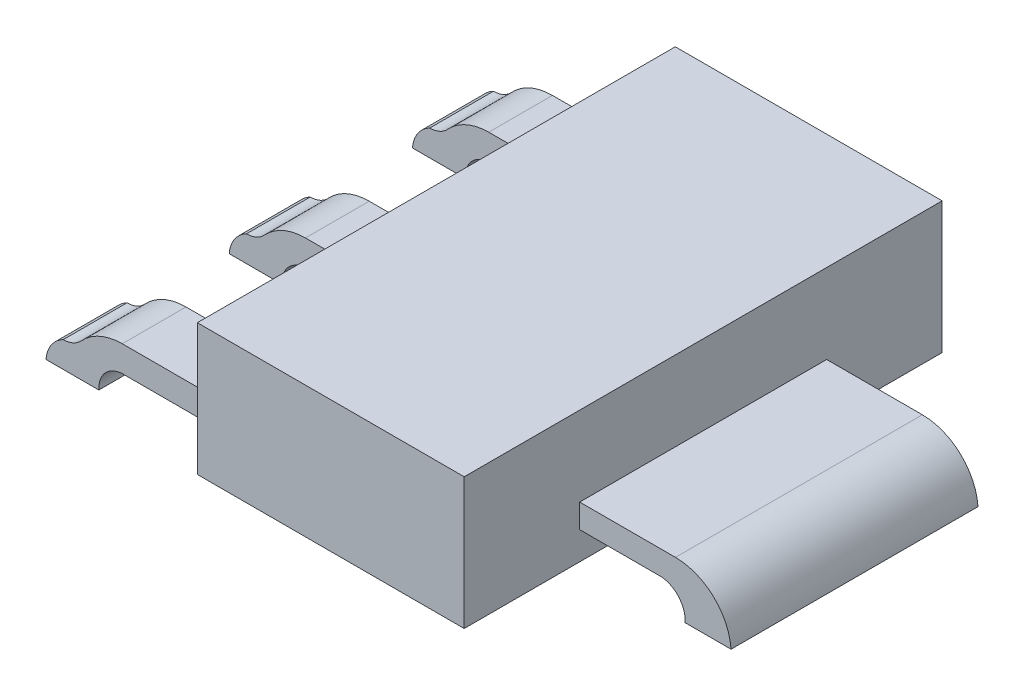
ISO-10303-21;
HEADER;
FILE_DESCRIPTION(('STEP AP214'),'2;1');
FILE_NAME('part.step','',(''),(''),'','','');
FILE_SCHEMA(('AUTOMOTIVE_DESIGN { 1 0 10303 214 1 1 1 1 }'));
ENDSEC;
DATA;
#1=APPLICATION_CONTEXT('core data for automotive mechanical design processes');
#2=APPLICATION_PROTOCOL_DEFINITION('international standard','automotive_design',2000,#1);
#3=PRODUCT_CONTEXT('',#1,'mechanical');
#4=PRODUCT('Part','Part','',(#3));
#5=PRODUCT_RELATED_PRODUCT_CATEGORY('part','',(#4));
#6=PRODUCT_DEFINITION_FORMATION('','',#4);
#7=PRODUCT_DEFINITION_CONTEXT('part definition',#1,'design');
#8=PRODUCT_DEFINITION('design','',#6,#7);
#9=PRODUCT_DEFINITION_SHAPE('','',#8);
#10=(LENGTH_UNIT() NAMED_UNIT(*) SI_UNIT(.MILLI.,.METRE.));
#11=(NAMED_UNIT(*) PLANE_ANGLE_UNIT() SI_UNIT($,.RADIAN.));
#12=(NAMED_UNIT(*) SI_UNIT($,.STERADIAN.) SOLID_ANGLE_UNIT());
#13=UNCERTAINTY_MEASURE_WITH_UNIT(LENGTH_MEASURE(1.E-05),#10,'distance_accuracy_value','');
#14=(GEOMETRIC_REPRESENTATION_CONTEXT(3) GLOBAL_UNCERTAINTY_ASSIGNED_CONTEXT((#13)) GLOBAL_UNIT_ASSIGNED_CONTEXT((#10,
#11,#12)) REPRESENTATION_CONTEXT('',''));
#15=CARTESIAN_POINT('',(0.,0.,0.));
#16=DIRECTION('',(0.,0.,1.));
#17=DIRECTION('',(1.,0.,0.));
#18=AXIS2_PLACEMENT_3D('',#15,#16,#17);
#19=CARTESIAN_POINT('',(1.575,1.651,3.9));
#20=DIRECTION('',(0.,1.,0.));
#21=DIRECTION('',(0.,0.,1.));
#22=AXIS2_PLACEMENT_3D('',#19,#20,#21);
#23=PLANE('',#22);
#24=DIRECTION('',(0.,0.,1.));
#25=VECTOR('',#24,1.);
#26=CARTESIAN_POINT('',(5.15000000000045,1.65100000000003,5.45));
#27=LINE('',#26,#25);
#28=CARTESIAN_POINT('',(5.15000000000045,1.65100000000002,5.45));
#29=VERTEX_POINT('',#28);
#30=CARTESIAN_POINT('',(5.15000000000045,1.65100000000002,2.35));
#31=VERTEX_POINT('',#30);
#32=EDGE_CURVE('E243',#29,#31,#27,.F.);
#33=ORIENTED_EDGE('',*,*,#32,.F.);
#34=DIRECTION('',(1.,0.,0.));
#35=VECTOR('',#34,1.);
#36=CARTESIAN_POINT('',(1.575,1.651,5.45));
#37=LINE('',#36,#35);
#38=CARTESIAN_POINT('',(4.573435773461,1.651,5.45));
#39=VERTEX_POINT('',#38);
#40=EDGE_CURVE('E250',#39,#29,#37,.T.);
#41=ORIENTED_EDGE('',*,*,#40,.F.);
#42=DIRECTION('',(0.,0.,1.));
#43=VECTOR('',#42,1.);
#44=CARTESIAN_POINT('',(4.573435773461,1.651,5.45));
#45=LINE('',#44,#43);
#46=CARTESIAN_POINT('',(4.573435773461,1.651,2.35));
#47=VERTEX_POINT('',#46);
#48=EDGE_CURVE('E246',#39,#47,#45,.F.);
#49=ORIENTED_EDGE('',*,*,#48,.T.);
#50=DIRECTION('',(1.,0.,0.));
#51=VECTOR('',#50,1.);
#52=CARTESIAN_POINT('',(1.575,1.651,2.35));
#53=LINE('',#52,#51);
#54=EDGE_CURVE('E241',#31,#47,#53,.F.);
#55=ORIENTED_EDGE('',*,*,#54,.F.);
#56=EDGE_LOOP('',(#33,#41,#49,#55));
#57=FACE_BOUND('',#56,.T.);
#58=ADVANCED_FACE('F17',(#57),#23,.F.);
#59=CARTESIAN_POINT('',(4.573435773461,1.682463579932,5.45));
#60=DIRECTION('',(1.,0.,0.));
#61=DIRECTION('',(0.,1.,0.));
#62=AXIS2_PLACEMENT_3D('',#59,#60,#61);
#63=PLANE('',#62);
#64=DIRECTION('',(0.,1.,0.));
#65=VECTOR('',#64,1.);
#66=CARTESIAN_POINT('',(4.573435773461,1.682463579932,5.45));
#67=LINE('',#66,#65);
#68=CARTESIAN_POINT('',(4.57343577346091,1.68246357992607,5.45));
#69=VERTEX_POINT('',#68);
#70=EDGE_CURVE('E411',#69,#39,#67,.F.);
#71=ORIENTED_EDGE('',*,*,#70,.F.);
#72=DIRECTION('',(0.,0.,-1.));
#73=VECTOR('',#72,1.);
#74=CARTESIAN_POINT('',(4.57343577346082,1.682463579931,5.45));
#75=LINE('',#74,#73);
#76=CARTESIAN_POINT('',(4.57343577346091,1.68246357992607,2.35));
#77=VERTEX_POINT('',#76);
#78=EDGE_CURVE('E265',#69,#77,#75,.T.);
#79=ORIENTED_EDGE('',*,*,#78,.T.);
#80=DIRECTION('',(0.,1.,0.));
#81=VECTOR('',#80,1.);
#82=CARTESIAN_POINT('',(4.573435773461,1.682463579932,2.35));
#83=LINE('',#82,#81);
#84=EDGE_CURVE('E249',#47,#77,#83,.T.);
#85=ORIENTED_EDGE('',*,*,#84,.F.);
#86=ORIENTED_EDGE('',*,*,#48,.F.);
#87=EDGE_LOOP('',(#71,#79,#85,#86));
#88=FACE_BOUND('',#87,.T.);
#89=ADVANCED_FACE('F1052',(#88),#63,.F.);
#90=CARTESIAN_POINT('',(-2.082924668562,2.281918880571,6.6));
#91=DIRECTION('',(0.,0.,-1.));
#92=DIRECTION('',(-1.,0.,0.));
#93=AXIS2_PLACEMENT_3D('',#90,#91,#92);
#94=CYLINDRICAL_SURFACE('',#93,0.3059188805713);
#95=DIRECTION('',(0.,0.,-1.));
#96=VECTOR('',#95,1.);
#97=CARTESIAN_POINT('',(-2.08292466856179,1.97599999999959,2.));
#98=LINE('',#97,#96);
#99=CARTESIAN_POINT('',(-2.08292466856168,1.97599999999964,2.));
#100=VERTEX_POINT('',#99);
#101=CARTESIAN_POINT('',(-2.08292466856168,1.97599999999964,1.2));
#102=VERTEX_POINT('',#101);
#103=EDGE_CURVE('E376',#100,#102,#98,.T.);
#104=ORIENTED_EDGE('',*,*,#103,.F.);
#105=CARTESIAN_POINT('',(-2.082924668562,2.281918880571,2.));
#106=DIRECTION('',(0.,0.,-1.));
#107=DIRECTION('',(-1.,0.,0.));
#108=AXIS2_PLACEMENT_3D('',#105,#106,#107);
#109=CIRCLE('',#108,0.3059188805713);
#110=CARTESIAN_POINT('',(-1.85774889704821,2.07483862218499,2.));
#111=VERTEX_POINT('',#110);
#112=EDGE_CURVE('E490',#111,#100,#109,.T.);
#113=ORIENTED_EDGE('',*,*,#112,.F.);
#114=DIRECTION('',(0.,0.,1.));
#115=VECTOR('',#114,1.);
#116=CARTESIAN_POINT('',(-1.8577488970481,2.0748386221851,6.6));
#117=LINE('',#116,#115);
#118=CARTESIAN_POINT('',(-1.85774889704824,2.07483862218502,1.2));
#119=VERTEX_POINT('',#118);
#120=EDGE_CURVE('E382',#119,#111,#117,.T.);
#121=ORIENTED_EDGE('',*,*,#120,.F.);
#122=CARTESIAN_POINT('',(-2.082924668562,2.281918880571,1.2));
#123=DIRECTION('',(0.,0.,-1.));
#124=DIRECTION('',(-1.,0.,0.));
#125=AXIS2_PLACEMENT_3D('',#122,#123,#124);
#126=CIRCLE('',#125,0.3059188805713);
#127=EDGE_CURVE('E405',#102,#119,#126,.F.);
#128=ORIENTED_EDGE('',*,*,#127,.F.);
#129=EDGE_LOOP('',(#104,#113,#121,#128));
#130=FACE_BOUND('',#129,.T.);
#131=ADVANCED_FACE('F615',(#130),#94,.F.);
#132=CARTESIAN_POINT('',(-1.342504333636,1.601,6.6));
#133=DIRECTION('',(0.,0.,1.));
#134=DIRECTION('',(1.,0.,0.));
#135=AXIS2_PLACEMENT_3D('',#132,#133,#134);
#136=CYLINDRICAL_SURFACE('',#135,0.7);
#137=CARTESIAN_POINT('',(-1.342504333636,1.601,2.));
#138=DIRECTION('',(0.,0.,1.));
#139=DIRECTION('',(1.,0.,0.));
#140=AXIS2_PLACEMENT_3D('',#137,#138,#139);
#141=CIRCLE('',#140,0.7);
#142=CARTESIAN_POINT('',(-1.342504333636,2.301,2.));
#143=VERTEX_POINT('',#142);
#144=EDGE_CURVE('E492',#143,#111,#141,.T.);
#145=ORIENTED_EDGE('',*,*,#144,.F.);
#146=DIRECTION('',(0.,0.,-1.));
#147=VECTOR('',#146,1.);
#148=CARTESIAN_POINT('',(-1.342504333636,2.301,3.9));
#149=LINE('',#148,#147);
#150=CARTESIAN_POINT('',(-1.342504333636,2.301,1.2));
#151=VERTEX_POINT('',#150);
#152=EDGE_CURVE('E267',#143,#151,#149,.T.);
#153=ORIENTED_EDGE('',*,*,#152,.T.);
#154=CARTESIAN_POINT('',(-1.342504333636,1.601,1.2));
#155=DIRECTION('',(0.,0.,1.));
#156=DIRECTION('',(1.,0.,0.));
#157=AXIS2_PLACEMENT_3D('',#154,#155,#156);
#158=CIRCLE('',#157,0.7);
#159=EDGE_CURVE('E483',#119,#151,#158,.F.);
#160=ORIENTED_EDGE('',*,*,#159,.F.);
#161=ORIENTED_EDGE('',*,*,#120,.T.);
#162=EDGE_LOOP('',(#145,#153,#160,#161));
#163=FACE_BOUND('',#162,.T.);
#164=ADVANCED_FACE('F619',(#163),#136,.T.);
#165=CARTESIAN_POINT('',(-1.331039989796,1.670160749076,6.6));
#166=DIRECTION('',(0.,0.,-1.));
#167=DIRECTION('',(-1.,0.,0.));
#168=AXIS2_PLACEMENT_3D('',#165,#166,#167);
#169=CYLINDRICAL_SURFACE('',#168,0.3058392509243);
#170=CARTESIAN_POINT('',(-1.331039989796,1.670160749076,2.));
#171=DIRECTION('',(0.,0.,-1.));
#172=DIRECTION('',(-1.,0.,0.));
#173=AXIS2_PLACEMENT_3D('',#170,#171,#172);
#174=CIRCLE('',#173,0.3058392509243);
#175=CARTESIAN_POINT('',(-1.63627844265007,1.651,2.));
#176=VERTEX_POINT('',#175);
#177=CARTESIAN_POINT('',(-1.3310399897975,1.976,2.));
#178=VERTEX_POINT('',#177);
#179=EDGE_CURVE('E495',#176,#178,#174,.T.);
#180=ORIENTED_EDGE('',*,*,#179,.F.);
#181=DIRECTION('',(0.,0.,1.));
#182=VECTOR('',#181,1.);
#183=CARTESIAN_POINT('',(-1.63627844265,1.651,3.9));
#184=LINE('',#183,#182);
#185=CARTESIAN_POINT('',(-1.63627844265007,1.651,1.2));
#186=VERTEX_POINT('',#185);
#187=EDGE_CURVE('E378',#176,#186,#184,.F.);
#188=ORIENTED_EDGE('',*,*,#187,.T.);
#189=CARTESIAN_POINT('',(-1.331039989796,1.670160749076,1.2));
#190=DIRECTION('',(0.,0.,-1.));
#191=DIRECTION('',(-1.,0.,0.));
#192=AXIS2_PLACEMENT_3D('',#189,#190,#191);
#193=CIRCLE('',#192,0.3058392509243);
#194=CARTESIAN_POINT('',(-1.3310399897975,1.976,1.2));
#195=VERTEX_POINT('',#194);
#196=EDGE_CURVE('E480',#195,#186,#193,.F.);
#197=ORIENTED_EDGE('',*,*,#196,.F.);
#198=DIRECTION('',(0.,0.,1.));
#199=VECTOR('',#198,1.);
#200=CARTESIAN_POINT('',(-1.331039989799,1.976,6.6));
#201=LINE('',#200,#199);
#202=EDGE_CURVE('E383',#195,#178,#201,.T.);
#203=ORIENTED_EDGE('',*,*,#202,.T.);
#204=EDGE_LOOP('',(#180,#188,#197,#203));
#205=FACE_BOUND('',#204,.T.);
#206=ADVANCED_FACE('F604',(#205),#169,.F.);
#207=CARTESIAN_POINT('',(1.575,1.651,3.9));
#208=DIRECTION('',(0.,1.,0.));
#209=DIRECTION('',(0.,0.,1.));
#210=AXIS2_PLACEMENT_3D('',#207,#208,#209);
#211=PLANE('',#210);
#212=DIRECTION('',(0.,0.,-1.));
#213=VECTOR('',#212,1.);
#214=CARTESIAN_POINT('',(-2.29999999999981,1.65099999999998,2.));
#215=LINE('',#214,#213);
#216=CARTESIAN_POINT('',(-2.29999999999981,1.65099999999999,1.2));
#217=VERTEX_POINT('',#216);
#218=CARTESIAN_POINT('',(-2.29999999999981,1.65099999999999,2.));
#219=VERTEX_POINT('',#218);
#220=EDGE_CURVE('E367',#217,#219,#215,.F.);
#221=ORIENTED_EDGE('',*,*,#220,.F.);
#222=DIRECTION('',(-1.,0.,0.));
#223=VECTOR('',#222,1.);
#224=CARTESIAN_POINT('',(-0.1,1.651,1.2));
#225=LINE('',#224,#223);
#226=EDGE_CURVE('E479',#186,#217,#225,.T.);
#227=ORIENTED_EDGE('',*,*,#226,.F.);
#228=ORIENTED_EDGE('',*,*,#187,.F.);
#229=DIRECTION('',(1.,0.,0.));
#230=VECTOR('',#229,1.);
#231=CARTESIAN_POINT('',(-2.3,1.651,2.));
#232=LINE('',#231,#230);
#233=EDGE_CURVE('E273',#219,#176,#232,.T.);
#234=ORIENTED_EDGE('',*,*,#233,.F.);
#235=EDGE_LOOP('',(#221,#227,#228,#234));
#236=FACE_BOUND('',#235,.T.);
#237=ADVANCED_FACE('F608',(#236),#211,.F.);
#238=CARTESIAN_POINT('',(-1.901230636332,1.619647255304,2.));
#239=DIRECTION('',(0.,0.,-1.));
#240=DIRECTION('',(-1.,0.,0.));
#241=AXIS2_PLACEMENT_3D('',#238,#239,#240);
#242=CYLINDRICAL_SURFACE('',#241,0.4);
#243=ORIENTED_EDGE('',*,*,#220,.T.);
#244=CARTESIAN_POINT('',(-1.901230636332,1.619647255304,2.));
#245=DIRECTION('',(0.,0.,-1.));
#246=DIRECTION('',(-1.,0.,0.));
#247=AXIS2_PLACEMENT_3D('',#244,#245,#246);
#248=CIRCLE('',#247,0.4);
#249=EDGE_CURVE('E387',#100,#219,#248,.F.);
#250=ORIENTED_EDGE('',*,*,#249,.F.);
#251=ORIENTED_EDGE('',*,*,#103,.T.);
#252=CARTESIAN_POINT('',(-1.901230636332,1.619647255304,1.2));
#253=DIRECTION('',(0.,0.,-1.));
#254=DIRECTION('',(-1.,0.,0.));
#255=AXIS2_PLACEMENT_3D('',#252,#253,#254);
#256=CIRCLE('',#255,0.4);
#257=EDGE_CURVE('E360',#217,#102,#256,.T.);
#258=ORIENTED_EDGE('',*,*,#257,.F.);
#259=EDGE_LOOP('',(#243,#250,#251,#258));
#260=FACE_BOUND('',#259,.T.);
#261=ADVANCED_FACE('F620',(#260),#242,.T.);
#262=CARTESIAN_POINT('',(-2.082924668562,2.281918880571,6.6));
#263=DIRECTION('',(0.,0.,-1.));
#264=DIRECTION('',(-1.,0.,0.));
#265=AXIS2_PLACEMENT_3D('',#262,#263,#264);
#266=CYLINDRICAL_SURFACE('',#265,0.3059188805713);
#267=DIRECTION('',(0.,0.,-1.));
#268=VECTOR('',#267,1.);
#269=CARTESIAN_POINT('',(-2.08292466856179,1.97599999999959,4.3));
#270=LINE('',#269,#268);
#271=CARTESIAN_POINT('',(-2.08292466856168,1.97599999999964,4.3));
#272=VERTEX_POINT('',#271);
#273=CARTESIAN_POINT('',(-2.08292466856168,1.97599999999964,3.5));
#274=VERTEX_POINT('',#273);
#275=EDGE_CURVE('E335',#272,#274,#270,.T.);
#276=ORIENTED_EDGE('',*,*,#275,.F.);
#277=CARTESIAN_POINT('',(-2.082924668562,2.281918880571,4.3));
#278=DIRECTION('',(0.,0.,-1.));
#279=DIRECTION('',(-1.,0.,0.));
#280=AXIS2_PLACEMENT_3D('',#277,#278,#279);
#281=CIRCLE('',#280,0.3059188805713);
#282=CARTESIAN_POINT('',(-1.85774889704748,2.07483862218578,4.3));
#283=VERTEX_POINT('',#282);
#284=EDGE_CURVE('E469',#283,#272,#281,.T.);
#285=ORIENTED_EDGE('',*,*,#284,.F.);
#286=DIRECTION('',(0.,0.,1.));
#287=VECTOR('',#286,1.);
#288=CARTESIAN_POINT('',(-1.85774889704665,2.07483862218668,6.6));
#289=LINE('',#288,#287);
#290=CARTESIAN_POINT('',(-1.85774889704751,2.07483862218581,3.5));
#291=VERTEX_POINT('',#290);
#292=EDGE_CURVE('E341',#291,#283,#289,.T.);
#293=ORIENTED_EDGE('',*,*,#292,.F.);
#294=CARTESIAN_POINT('',(-2.082924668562,2.281918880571,3.5));
#295=DIRECTION('',(0.,0.,-1.));
#296=DIRECTION('',(-1.,0.,0.));
#297=AXIS2_PLACEMENT_3D('',#294,#295,#296);
#298=CIRCLE('',#297,0.3059188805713);
#299=EDGE_CURVE('E370',#274,#291,#298,.F.);
#300=ORIENTED_EDGE('',*,*,#299,.F.);
#301=EDGE_LOOP('',(#276,#285,#293,#300));
#302=FACE_BOUND('',#301,.T.);
#303=ADVANCED_FACE('F622',(#302),#266,.F.);
#304=CARTESIAN_POINT('',(-1.342504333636,1.601,6.6));
#305=DIRECTION('',(0.,0.,1.));
#306=DIRECTION('',(1.,0.,0.));
#307=AXIS2_PLACEMENT_3D('',#304,#305,#306);
#308=CYLINDRICAL_SURFACE('',#307,0.7);
#309=CARTESIAN_POINT('',(-1.342504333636,1.601,4.3));
#310=DIRECTION('',(0.,0.,1.));
#311=DIRECTION('',(1.,0.,0.));
#312=AXIS2_PLACEMENT_3D('',#309,#310,#311);
#313=CIRCLE('',#312,0.7);
#314=CARTESIAN_POINT('',(-1.342504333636,2.301,4.3));
#315=VERTEX_POINT('',#314);
#316=EDGE_CURVE('E471',#315,#283,#313,.T.);
#317=ORIENTED_EDGE('',*,*,#316,.F.);
#318=DIRECTION('',(0.,0.,-1.));
#319=VECTOR('',#318,1.);
#320=CARTESIAN_POINT('',(-1.342504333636,2.301,3.9));
#321=LINE('',#320,#319);
#322=CARTESIAN_POINT('',(-1.342504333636,2.301,3.5));
#323=VERTEX_POINT('',#322);
#324=EDGE_CURVE('E356',#315,#323,#321,.T.);
#325=ORIENTED_EDGE('',*,*,#324,.T.);
#326=CARTESIAN_POINT('',(-1.342504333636,1.601,3.5));
#327=DIRECTION('',(0.,0.,1.));
#328=DIRECTION('',(1.,0.,0.));
#329=AXIS2_PLACEMENT_3D('',#326,#327,#328);
#330=CIRCLE('',#329,0.7);
#331=EDGE_CURVE('E462',#291,#323,#330,.F.);
#332=ORIENTED_EDGE('',*,*,#331,.F.);
#333=ORIENTED_EDGE('',*,*,#292,.T.);
#334=EDGE_LOOP('',(#317,#325,#332,#333));
#335=FACE_BOUND('',#334,.T.);
#336=ADVANCED_FACE('F629',(#335),#308,.T.);
#337=CARTESIAN_POINT('',(-1.331039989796,1.670160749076,6.6));
#338=DIRECTION('',(0.,0.,-1.));
#339=DIRECTION('',(-1.,0.,0.));
#340=AXIS2_PLACEMENT_3D('',#337,#338,#339);
#341=CYLINDRICAL_SURFACE('',#340,0.3058392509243);
#342=CARTESIAN_POINT('',(-1.331039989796,1.670160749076,4.3));
#343=DIRECTION('',(0.,0.,-1.));
#344=DIRECTION('',(-1.,0.,0.));
#345=AXIS2_PLACEMENT_3D('',#342,#343,#344);
#346=CIRCLE('',#345,0.3058392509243);
#347=CARTESIAN_POINT('',(-1.63627844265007,1.651,4.3));
#348=VERTEX_POINT('',#347);
#349=CARTESIAN_POINT('',(-1.3310399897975,1.976,4.3));
#350=VERTEX_POINT('',#349);
#351=EDGE_CURVE('E475',#348,#350,#346,.T.);
#352=ORIENTED_EDGE('',*,*,#351,.F.);
#353=DIRECTION('',(0.,0.,1.));
#354=VECTOR('',#353,1.);
#355=CARTESIAN_POINT('',(-1.63627844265,1.651,3.9));
#356=LINE('',#355,#354);
#357=CARTESIAN_POINT('',(-1.63627844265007,1.651,3.5));
#358=VERTEX_POINT('',#357);
#359=EDGE_CURVE('E337',#348,#358,#356,.F.);
#360=ORIENTED_EDGE('',*,*,#359,.T.);
#361=CARTESIAN_POINT('',(-1.331039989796,1.670160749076,3.5));
#362=DIRECTION('',(0.,0.,-1.));
#363=DIRECTION('',(-1.,0.,0.));
#364=AXIS2_PLACEMENT_3D('',#361,#362,#363);
#365=CIRCLE('',#364,0.3058392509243);
#366=CARTESIAN_POINT('',(-1.3310399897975,1.976,3.5));
#367=VERTEX_POINT('',#366);
#368=EDGE_CURVE('E459',#367,#358,#365,.F.);
#369=ORIENTED_EDGE('',*,*,#368,.F.);
#370=DIRECTION('',(0.,0.,1.));
#371=VECTOR('',#370,1.);
#372=CARTESIAN_POINT('',(-1.331039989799,1.976,6.6));
#373=LINE('',#372,#371);
#374=EDGE_CURVE('E342',#367,#350,#373,.T.);
#375=ORIENTED_EDGE('',*,*,#374,.T.);
#376=EDGE_LOOP('',(#352,#360,#369,#375));
#377=FACE_BOUND('',#376,.T.);
#378=ADVANCED_FACE('F738',(#377),#341,.F.);
#379=CARTESIAN_POINT('',(1.575,1.651,3.9));
#380=DIRECTION('',(0.,1.,0.));
#381=DIRECTION('',(0.,0.,1.));
#382=AXIS2_PLACEMENT_3D('',#379,#380,#381);
#383=PLANE('',#382);
#384=DIRECTION('',(0.,0.,-1.));
#385=VECTOR('',#384,1.);
#386=CARTESIAN_POINT('',(-2.29999999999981,1.65099999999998,4.3));
#387=LINE('',#386,#385);
#388=CARTESIAN_POINT('',(-2.29999999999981,1.65099999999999,3.5));
#389=VERTEX_POINT('',#388);
#390=CARTESIAN_POINT('',(-2.29999999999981,1.65099999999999,4.3));
#391=VERTEX_POINT('',#390);
#392=EDGE_CURVE('E326',#389,#391,#387,.F.);
#393=ORIENTED_EDGE('',*,*,#392,.F.);
#394=DIRECTION('',(-1.,0.,0.));
#395=VECTOR('',#394,1.);
#396=CARTESIAN_POINT('',(-0.1,1.651,3.5));
#397=LINE('',#396,#395);
#398=EDGE_CURVE('E458',#358,#389,#397,.T.);
#399=ORIENTED_EDGE('',*,*,#398,.F.);
#400=ORIENTED_EDGE('',*,*,#359,.F.);
#401=DIRECTION('',(1.,0.,0.));
#402=VECTOR('',#401,1.);
#403=CARTESIAN_POINT('',(-2.3,1.651,4.3));
#404=LINE('',#403,#402);
#405=EDGE_CURVE('E359',#391,#348,#404,.T.);
#406=ORIENTED_EDGE('',*,*,#405,.F.);
#407=EDGE_LOOP('',(#393,#399,#400,#406));
#408=FACE_BOUND('',#407,.T.);
#409=ADVANCED_FACE('F734',(#408),#383,.F.);
#410=CARTESIAN_POINT('',(-1.901230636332,1.619647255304,4.3));
#411=DIRECTION('',(0.,0.,-1.));
#412=DIRECTION('',(-1.,0.,0.));
#413=AXIS2_PLACEMENT_3D('',#410,#411,#412);
#414=CYLINDRICAL_SURFACE('',#413,0.4);
#415=ORIENTED_EDGE('',*,*,#392,.T.);
#416=CARTESIAN_POINT('',(-1.901230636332,1.619647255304,4.3));
#417=DIRECTION('',(0.,0.,-1.));
#418=DIRECTION('',(-1.,0.,0.));
#419=AXIS2_PLACEMENT_3D('',#416,#417,#418);
#420=CIRCLE('',#419,0.4);
#421=EDGE_CURVE('E346',#272,#391,#420,.F.);
#422=ORIENTED_EDGE('',*,*,#421,.F.);
#423=ORIENTED_EDGE('',*,*,#275,.T.);
#424=CARTESIAN_POINT('',(-1.901230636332,1.619647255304,3.5));
#425=DIRECTION('',(0.,0.,-1.));
#426=DIRECTION('',(-1.,0.,0.));
#427=AXIS2_PLACEMENT_3D('',#424,#425,#426);
#428=CIRCLE('',#427,0.4);
#429=EDGE_CURVE('E319',#389,#274,#428,.T.);
#430=ORIENTED_EDGE('',*,*,#429,.F.);
#431=EDGE_LOOP('',(#415,#422,#423,#430));
#432=FACE_BOUND('',#431,.T.);
#433=ADVANCED_FACE('F730',(#432),#414,.T.);
#434=CARTESIAN_POINT('',(-2.082924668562,2.281918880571,6.6));
#435=DIRECTION('',(0.,0.,-1.));
#436=DIRECTION('',(-1.,0.,0.));
#437=AXIS2_PLACEMENT_3D('',#434,#435,#436);
#438=CYLINDRICAL_SURFACE('',#437,0.3059188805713);
#439=DIRECTION('',(0.,0.,-1.));
#440=VECTOR('',#439,1.);
#441=CARTESIAN_POINT('',(-2.08292466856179,1.97599999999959,5.8));
#442=LINE('',#441,#440);
#443=CARTESIAN_POINT('',(-2.08292466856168,1.97599999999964,6.6));
#444=VERTEX_POINT('',#443);
#445=CARTESIAN_POINT('',(-2.08292466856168,1.97599999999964,5.8));
#446=VERTEX_POINT('',#445);
#447=EDGE_CURVE('E292',#444,#446,#442,.T.);
#448=ORIENTED_EDGE('',*,*,#447,.F.);
#449=CARTESIAN_POINT('',(-2.082924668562,2.281918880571,6.6));
#450=DIRECTION('',(0.,0.,-1.));
#451=DIRECTION('',(-1.,0.,0.));
#452=AXIS2_PLACEMENT_3D('',#449,#450,#451);
#453=CIRCLE('',#452,0.3059188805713);
#454=CARTESIAN_POINT('',(-1.85774889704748,2.07483862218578,6.6));
#455=VERTEX_POINT('',#454);
#456=EDGE_CURVE('E448',#455,#444,#453,.T.);
#457=ORIENTED_EDGE('',*,*,#456,.F.);
#458=DIRECTION('',(0.,0.,1.));
#459=VECTOR('',#458,1.);
#460=CARTESIAN_POINT('',(-1.85774889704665,2.07483862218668,6.6));
#461=LINE('',#460,#459);
#462=CARTESIAN_POINT('',(-1.85774889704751,2.07483862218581,5.8));
#463=VERTEX_POINT('',#462);
#464=EDGE_CURVE('E298',#463,#455,#461,.T.);
#465=ORIENTED_EDGE('',*,*,#464,.F.);
#466=CARTESIAN_POINT('',(-2.082924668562,2.281918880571,5.8));
#467=DIRECTION('',(0.,0.,-1.));
#468=DIRECTION('',(-1.,0.,0.));
#469=AXIS2_PLACEMENT_3D('',#466,#467,#468);
#470=CIRCLE('',#469,0.3059188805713);
#471=EDGE_CURVE('E329',#446,#463,#470,.F.);
#472=ORIENTED_EDGE('',*,*,#471,.F.);
#473=EDGE_LOOP('',(#448,#457,#465,#472));
#474=FACE_BOUND('',#473,.T.);
#475=ADVANCED_FACE('F726',(#474),#438,.F.);
#476=CARTESIAN_POINT('',(-1.342504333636,1.601,6.6));
#477=DIRECTION('',(0.,0.,1.));
#478=DIRECTION('',(1.,0.,0.));
#479=AXIS2_PLACEMENT_3D('',#476,#477,#478);
#480=CYLINDRICAL_SURFACE('',#479,0.7);
#481=CARTESIAN_POINT('',(-1.342504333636,1.601,6.6));
#482=DIRECTION('',(0.,0.,1.));
#483=DIRECTION('',(1.,0.,0.));
#484=AXIS2_PLACEMENT_3D('',#481,#482,#483);
#485=CIRCLE('',#484,0.7);
#486=CARTESIAN_POINT('',(-1.342504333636,2.301,6.6));
#487=VERTEX_POINT('',#486);
#488=EDGE_CURVE('E450',#487,#455,#485,.T.);
#489=ORIENTED_EDGE('',*,*,#488,.F.);
#490=DIRECTION('',(0.,0.,-1.));
#491=VECTOR('',#490,1.);
#492=CARTESIAN_POINT('',(-1.342504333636,2.301,3.9));
#493=LINE('',#492,#491);
#494=CARTESIAN_POINT('',(-1.342504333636,2.301,5.8));
#495=VERTEX_POINT('',#494);
#496=EDGE_CURVE('E315',#487,#495,#493,.T.);
#497=ORIENTED_EDGE('',*,*,#496,.T.);
#498=CARTESIAN_POINT('',(-1.342504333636,1.601,5.8));
#499=DIRECTION('',(0.,0.,1.));
#500=DIRECTION('',(1.,0.,0.));
#501=AXIS2_PLACEMENT_3D('',#498,#499,#500);
#502=CIRCLE('',#501,0.7);
#503=EDGE_CURVE('E441',#463,#495,#502,.F.);
#504=ORIENTED_EDGE('',*,*,#503,.F.);
#505=ORIENTED_EDGE('',*,*,#464,.T.);
#506=EDGE_LOOP('',(#489,#497,#504,#505));
#507=FACE_BOUND('',#506,.T.);
#508=ADVANCED_FACE('F722',(#507),#480,.T.);
#509=CARTESIAN_POINT('',(-1.331039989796,1.670160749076,6.6));
#510=DIRECTION('',(0.,0.,-1.));
#511=DIRECTION('',(-1.,0.,0.));
#512=AXIS2_PLACEMENT_3D('',#509,#510,#511);
#513=CYLINDRICAL_SURFACE('',#512,0.3058392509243);
#514=CARTESIAN_POINT('',(-1.331039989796,1.670160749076,6.6));
#515=DIRECTION('',(0.,0.,-1.));
#516=DIRECTION('',(-1.,0.,0.));
#517=AXIS2_PLACEMENT_3D('',#514,#515,#516);
#518=CIRCLE('',#517,0.3058392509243);
#519=CARTESIAN_POINT('',(-1.63627844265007,1.651,6.6));
#520=VERTEX_POINT('',#519);
#521=CARTESIAN_POINT('',(-1.3310399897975,1.976,6.6));
#522=VERTEX_POINT('',#521);
#523=EDGE_CURVE('E454',#520,#522,#518,.T.);
#524=ORIENTED_EDGE('',*,*,#523,.F.);
#525=DIRECTION('',(0.,0.,1.));
#526=VECTOR('',#525,1.);
#527=CARTESIAN_POINT('',(-1.63627844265,1.651,3.9));
#528=LINE('',#527,#526);
#529=CARTESIAN_POINT('',(-1.63627844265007,1.651,5.8));
#530=VERTEX_POINT('',#529);
#531=EDGE_CURVE('E294',#520,#530,#528,.F.);
#532=ORIENTED_EDGE('',*,*,#531,.T.);
#533=CARTESIAN_POINT('',(-1.331039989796,1.670160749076,5.8));
#534=DIRECTION('',(0.,0.,-1.));
#535=DIRECTION('',(-1.,0.,0.));
#536=AXIS2_PLACEMENT_3D('',#533,#534,#535);
#537=CIRCLE('',#536,0.3058392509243);
#538=CARTESIAN_POINT('',(-1.3310399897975,1.976,5.8));
#539=VERTEX_POINT('',#538);
#540=EDGE_CURVE('E438',#539,#530,#537,.F.);
#541=ORIENTED_EDGE('',*,*,#540,.F.);
#542=DIRECTION('',(0.,0.,1.));
#543=VECTOR('',#542,1.);
#544=CARTESIAN_POINT('',(-1.331039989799,1.976,6.6));
#545=LINE('',#544,#543);
#546=EDGE_CURVE('E299',#539,#522,#545,.T.);
#547=ORIENTED_EDGE('',*,*,#546,.T.);
#548=EDGE_LOOP('',(#524,#532,#541,#547));
#549=FACE_BOUND('',#548,.T.);
#550=ADVANCED_FACE('F718',(#549),#513,.F.);
#551=CARTESIAN_POINT('',(1.575,1.651,3.9));
#552=DIRECTION('',(0.,1.,0.));
#553=DIRECTION('',(0.,0.,1.));
#554=AXIS2_PLACEMENT_3D('',#551,#552,#553);
#555=PLANE('',#554);
#556=DIRECTION('',(0.,0.,-1.));
#557=VECTOR('',#556,1.);
#558=CARTESIAN_POINT('',(-2.29999999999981,1.65099999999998,5.8));
#559=LINE('',#558,#557);
#560=CARTESIAN_POINT('',(-2.29999999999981,1.65099999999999,5.8));
#561=VERTEX_POINT('',#560);
#562=CARTESIAN_POINT('',(-2.29999999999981,1.65099999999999,6.6));
#563=VERTEX_POINT('',#562);
#564=EDGE_CURVE('E258',#561,#563,#559,.F.);
#565=ORIENTED_EDGE('',*,*,#564,.F.);
#566=DIRECTION('',(-1.,0.,0.));
#567=VECTOR('',#566,1.);
#568=CARTESIAN_POINT('',(-0.1,1.651,5.8));
#569=LINE('',#568,#567);
#570=EDGE_CURVE('E437',#530,#561,#569,.T.);
#571=ORIENTED_EDGE('',*,*,#570,.F.);
#572=ORIENTED_EDGE('',*,*,#531,.F.);
#573=DIRECTION('',(1.,0.,0.));
#574=VECTOR('',#573,1.);
#575=CARTESIAN_POINT('',(-2.3,1.651,6.6));
#576=LINE('',#575,#574);
#577=EDGE_CURVE('E318',#563,#520,#576,.T.);
#578=ORIENTED_EDGE('',*,*,#577,.F.);
#579=EDGE_LOOP('',(#565,#571,#572,#578));
#580=FACE_BOUND('',#579,.T.);
#581=ADVANCED_FACE('F714',(#580),#555,.F.);
#582=CARTESIAN_POINT('',(-1.901230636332,1.619647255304,5.8));
#583=DIRECTION('',(0.,0.,-1.));
#584=DIRECTION('',(-1.,0.,0.));
#585=AXIS2_PLACEMENT_3D('',#582,#583,#584);
#586=CYLINDRICAL_SURFACE('',#585,0.4);
#587=ORIENTED_EDGE('',*,*,#564,.T.);
#588=CARTESIAN_POINT('',(-1.901230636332,1.619647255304,6.6));
#589=DIRECTION('',(0.,0.,-1.));
#590=DIRECTION('',(-1.,0.,0.));
#591=AXIS2_PLACEMENT_3D('',#588,#589,#590);
#592=CIRCLE('',#591,0.4);
#593=EDGE_CURVE('E303',#444,#563,#592,.F.);
#594=ORIENTED_EDGE('',*,*,#593,.F.);
#595=ORIENTED_EDGE('',*,*,#447,.T.);
#596=CARTESIAN_POINT('',(-1.901230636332,1.619647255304,5.8));
#597=DIRECTION('',(0.,0.,-1.));
#598=DIRECTION('',(-1.,0.,0.));
#599=AXIS2_PLACEMENT_3D('',#596,#597,#598);
#600=CIRCLE('',#599,0.4);
#601=EDGE_CURVE('E434',#561,#446,#600,.T.);
#602=ORIENTED_EDGE('',*,*,#601,.F.);
#603=EDGE_LOOP('',(#587,#594,#595,#602));
#604=FACE_BOUND('',#603,.T.);
#605=ADVANCED_FACE('F711',(#604),#586,.T.);
#606=CARTESIAN_POINT('',(4.451787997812,1.601,5.45));
#607=DIRECTION('',(0.,0.,1.));
#608=DIRECTION('',(1.,0.,0.));
#609=AXIS2_PLACEMENT_3D('',#606,#607,#608);
#610=CYLINDRICAL_SURFACE('',#609,0.7);
#611=ORIENTED_EDGE('',*,*,#32,.T.);
#612=CARTESIAN_POINT('',(4.451787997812,1.601,2.35));
#613=DIRECTION('',(0.,0.,1.));
#614=DIRECTION('',(1.,0.,0.));
#615=AXIS2_PLACEMENT_3D('',#612,#613,#614);
#616=CIRCLE('',#615,0.7);
#617=CARTESIAN_POINT('',(4.451787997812,2.301,2.35));
#618=VERTEX_POINT('',#617);
#619=EDGE_CURVE('E20',#31,#618,#616,.T.);
#620=ORIENTED_EDGE('',*,*,#619,.T.);
#621=DIRECTION('',(0.,0.,-1.));
#622=VECTOR('',#621,1.);
#623=CARTESIAN_POINT('',(4.451787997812,2.301,3.9));
#624=LINE('',#623,#622);
#625=CARTESIAN_POINT('',(4.451787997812,2.301,5.45));
#626=VERTEX_POINT('',#625);
#627=EDGE_CURVE('E279',#618,#626,#624,.F.);
#628=ORIENTED_EDGE('',*,*,#627,.T.);
#629=CARTESIAN_POINT('',(4.451787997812,1.601,5.45));
#630=DIRECTION('',(0.,0.,1.));
#631=DIRECTION('',(1.,0.,0.));
#632=AXIS2_PLACEMENT_3D('',#629,#630,#631);
#633=CIRCLE('',#632,0.7);
#634=EDGE_CURVE('E257',#29,#626,#633,.T.);
#635=ORIENTED_EDGE('',*,*,#634,.F.);
#636=EDGE_LOOP('',(#611,#620,#628,#635));
#637=FACE_BOUND('',#636,.T.);
#638=ADVANCED_FACE('F254',(#637),#610,.T.);
#639=CARTESIAN_POINT('',(4.247656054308,1.676460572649,5.45));
#640=DIRECTION('',(0.,0.,-1.));
#641=DIRECTION('',(-1.,0.,0.));
#642=AXIS2_PLACEMENT_3D('',#639,#640,#641);
#643=CYLINDRICAL_SURFACE('',#642,0.3258350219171);
#644=CARTESIAN_POINT('',(4.247656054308,1.676460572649,5.45));
#645=DIRECTION('',(0.,0.,-1.));
#646=DIRECTION('',(-1.,0.,0.));
#647=AXIS2_PLACEMENT_3D('',#644,#645,#646);
#648=CIRCLE('',#647,0.3258350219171);
#649=CARTESIAN_POINT('',(4.27668399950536,2.001,5.45));
#650=VERTEX_POINT('',#649);
#651=EDGE_CURVE('E431',#650,#69,#648,.T.);
#652=ORIENTED_EDGE('',*,*,#651,.F.);
#653=DIRECTION('',(0.,0.,1.));
#654=VECTOR('',#653,1.);
#655=CARTESIAN_POINT('',(4.276683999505,2.001,5.45));
#656=LINE('',#655,#654);
#657=CARTESIAN_POINT('',(4.27668399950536,2.001,2.35));
#658=VERTEX_POINT('',#657);
#659=EDGE_CURVE('E507',#650,#658,#656,.F.);
#660=ORIENTED_EDGE('',*,*,#659,.T.);
#661=CARTESIAN_POINT('',(4.247656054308,1.676460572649,2.35));
#662=DIRECTION('',(0.,0.,-1.));
#663=DIRECTION('',(-1.,0.,0.));
#664=AXIS2_PLACEMENT_3D('',#661,#662,#663);
#665=CIRCLE('',#664,0.3258350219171);
#666=EDGE_CURVE('E427',#77,#658,#665,.F.);
#667=ORIENTED_EDGE('',*,*,#666,.F.);
#668=ORIENTED_EDGE('',*,*,#78,.F.);
#669=EDGE_LOOP('',(#652,#660,#667,#668));
#670=FACE_BOUND('',#669,.T.);
#671=ADVANCED_FACE('F705',(#670),#643,.F.);
#672=CARTESIAN_POINT('',(-1.2,2.301,3.9));
#673=DIRECTION('',(0.,-1.,0.));
#674=DIRECTION('',(0.,0.,-1.));
#675=AXIS2_PLACEMENT_3D('',#672,#673,#674);
#676=PLANE('',#675);
#677=DIRECTION('',(0.,0.,1.));
#678=VECTOR('',#677,1.);
#679=CARTESIAN_POINT('',(-0.1,2.301,0.9));
#680=LINE('',#679,#678);
#681=CARTESIAN_POINT('',(-0.1,2.301,1.2));
#682=VERTEX_POINT('',#681);
#683=CARTESIAN_POINT('',(-0.0999999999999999,2.301,2.));
#684=VERTEX_POINT('',#683);
#685=EDGE_CURVE('E397',#682,#684,#680,.T.);
#686=ORIENTED_EDGE('',*,*,#685,.F.);
#687=DIRECTION('',(-1.,0.,0.));
#688=VECTOR('',#687,1.);
#689=CARTESIAN_POINT('',(-0.1,2.301,1.2));
#690=LINE('',#689,#688);
#691=EDGE_CURVE('E485',#151,#682,#690,.F.);
#692=ORIENTED_EDGE('',*,*,#691,.F.);
#693=ORIENTED_EDGE('',*,*,#152,.F.);
#694=DIRECTION('',(1.,0.,0.));
#695=VECTOR('',#694,1.);
#696=CARTESIAN_POINT('',(-2.3,2.301,2.));
#697=LINE('',#696,#695);
#698=EDGE_CURVE('E494',#684,#143,#697,.F.);
#699=ORIENTED_EDGE('',*,*,#698,.F.);
#700=EDGE_LOOP('',(#686,#692,#693,#699));
#701=FACE_BOUND('',#700,.T.);
#702=ADVANCED_FACE('F597',(#701),#676,.F.);
#703=CARTESIAN_POINT('',(-2.3,1.651,2.));
#704=DIRECTION('',(0.,0.,1.));
#705=DIRECTION('',(1.,0.,0.));
#706=AXIS2_PLACEMENT_3D('',#703,#704,#705);
#707=PLANE('',#706);
#708=ORIENTED_EDGE('',*,*,#112,.T.);
#709=ORIENTED_EDGE('',*,*,#249,.T.);
#710=ORIENTED_EDGE('',*,*,#233,.T.);
#711=ORIENTED_EDGE('',*,*,#179,.T.);
#712=DIRECTION('',(1.,0.,0.));
#713=VECTOR('',#712,1.);
#714=CARTESIAN_POINT('',(-1.331039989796,1.976,2.));
#715=LINE('',#714,#713);
#716=CARTESIAN_POINT('',(-0.0999999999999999,1.976,2.));
#717=VERTEX_POINT('',#716);
#718=EDGE_CURVE('E386',#178,#717,#715,.T.);
#719=ORIENTED_EDGE('',*,*,#718,.T.);
#720=DIRECTION('',(0.,1.,0.));
#721=VECTOR('',#720,1.);
#722=CARTESIAN_POINT('',(-0.1,1.651,2.));
#723=LINE('',#722,#721);
#724=EDGE_CURVE('E390',#684,#717,#723,.F.);
#725=ORIENTED_EDGE('',*,*,#724,.F.);
#726=ORIENTED_EDGE('',*,*,#698,.T.);
#727=ORIENTED_EDGE('',*,*,#144,.T.);
#728=EDGE_LOOP('',(#708,#709,#710,#711,#719,#725,#726,#727));
#729=FACE_BOUND('',#728,.T.);
#730=ADVANCED_FACE('F599',(#729),#707,.T.);
#731=CARTESIAN_POINT('',(-1.331039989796,1.976,6.6));
#732=DIRECTION('',(0.,1.,0.));
#733=DIRECTION('',(0.,0.,1.));
#734=AXIS2_PLACEMENT_3D('',#731,#732,#733);
#735=PLANE('',#734);
#736=ORIENTED_EDGE('',*,*,#718,.F.);
#737=ORIENTED_EDGE('',*,*,#202,.F.);
#738=DIRECTION('',(-1.,0.,0.));
#739=VECTOR('',#738,1.);
#740=CARTESIAN_POINT('',(-0.1,1.976,1.2));
#741=LINE('',#740,#739);
#742=CARTESIAN_POINT('',(-0.1,1.976,1.2));
#743=VERTEX_POINT('',#742);
#744=EDGE_CURVE('E482',#743,#195,#741,.T.);
#745=ORIENTED_EDGE('',*,*,#744,.F.);
#746=DIRECTION('',(0.,0.,1.));
#747=VECTOR('',#746,1.);
#748=CARTESIAN_POINT('',(-0.1,1.976,0.9));
#749=LINE('',#748,#747);
#750=EDGE_CURVE('E388',#717,#743,#749,.F.);
#751=ORIENTED_EDGE('',*,*,#750,.F.);
#752=EDGE_LOOP('',(#736,#737,#745,#751));
#753=FACE_BOUND('',#752,.T.);
#754=ADVANCED_FACE('F601',(#753),#735,.F.);
#755=CARTESIAN_POINT('',(-0.1,1.651,1.2));
#756=DIRECTION('',(0.,0.,-1.));
#757=DIRECTION('',(-1.,0.,0.));
#758=AXIS2_PLACEMENT_3D('',#755,#756,#757);
#759=PLANE('',#758);
#760=ORIENTED_EDGE('',*,*,#226,.T.);
#761=ORIENTED_EDGE('',*,*,#257,.T.);
#762=ORIENTED_EDGE('',*,*,#127,.T.);
#763=ORIENTED_EDGE('',*,*,#159,.T.);
#764=ORIENTED_EDGE('',*,*,#691,.T.);
#765=DIRECTION('',(0.,1.,0.));
#766=VECTOR('',#765,1.);
#767=CARTESIAN_POINT('',(-0.1,1.651,1.2));
#768=LINE('',#767,#766);
#769=EDGE_CURVE('E363',#743,#682,#768,.T.);
#770=ORIENTED_EDGE('',*,*,#769,.F.);
#771=ORIENTED_EDGE('',*,*,#744,.T.);
#772=ORIENTED_EDGE('',*,*,#196,.T.);
#773=EDGE_LOOP('',(#760,#761,#762,#763,#764,#770,#771,#772));
#774=FACE_BOUND('',#773,.T.);
#775=ADVANCED_FACE('F587',(#774),#759,.T.);
#776=CARTESIAN_POINT('',(-1.2,2.301,3.9));
#777=DIRECTION('',(0.,-1.,0.));
#778=DIRECTION('',(0.,0.,-1.));
#779=AXIS2_PLACEMENT_3D('',#776,#777,#778);
#780=PLANE('',#779);
#781=DIRECTION('',(0.,0.,1.));
#782=VECTOR('',#781,1.);
#783=CARTESIAN_POINT('',(-0.1,2.301,0.9));
#784=LINE('',#783,#782);
#785=CARTESIAN_POINT('',(-0.1,2.301,3.5));
#786=VERTEX_POINT('',#785);
#787=CARTESIAN_POINT('',(-0.0999999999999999,2.301,4.3));
#788=VERTEX_POINT('',#787);
#789=EDGE_CURVE('E361',#786,#788,#784,.T.);
#790=ORIENTED_EDGE('',*,*,#789,.F.);
#791=DIRECTION('',(-1.,0.,0.));
#792=VECTOR('',#791,1.);
#793=CARTESIAN_POINT('',(-0.1,2.301,3.5));
#794=LINE('',#793,#792);
#795=EDGE_CURVE('E464',#323,#786,#794,.F.);
#796=ORIENTED_EDGE('',*,*,#795,.F.);
#797=ORIENTED_EDGE('',*,*,#324,.F.);
#798=DIRECTION('',(1.,0.,0.));
#799=VECTOR('',#798,1.);
#800=CARTESIAN_POINT('',(-2.3,2.301,4.3));
#801=LINE('',#800,#799);
#802=EDGE_CURVE('E474',#788,#315,#801,.F.);
#803=ORIENTED_EDGE('',*,*,#802,.F.);
#804=EDGE_LOOP('',(#790,#796,#797,#803));
#805=FACE_BOUND('',#804,.T.);
#806=ADVANCED_FACE('F692',(#805),#780,.F.);
#807=CARTESIAN_POINT('',(-2.3,1.651,4.3));
#808=DIRECTION('',(0.,0.,1.));
#809=DIRECTION('',(1.,0.,0.));
#810=AXIS2_PLACEMENT_3D('',#807,#808,#809);
#811=PLANE('',#810);
#812=ORIENTED_EDGE('',*,*,#284,.T.);
#813=ORIENTED_EDGE('',*,*,#421,.T.);
#814=ORIENTED_EDGE('',*,*,#405,.T.);
#815=ORIENTED_EDGE('',*,*,#351,.T.);
#816=DIRECTION('',(1.,0.,0.));
#817=VECTOR('',#816,1.);
#818=CARTESIAN_POINT('',(-1.331039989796,1.976,4.3));
#819=LINE('',#818,#817);
#820=CARTESIAN_POINT('',(-0.0999999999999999,1.976,4.3));
#821=VERTEX_POINT('',#820);
#822=EDGE_CURVE('E345',#350,#821,#819,.T.);
#823=ORIENTED_EDGE('',*,*,#822,.T.);
#824=DIRECTION('',(0.,1.,0.));
#825=VECTOR('',#824,1.);
#826=CARTESIAN_POINT('',(-0.1,1.651,4.3));
#827=LINE('',#826,#825);
#828=EDGE_CURVE('E349',#788,#821,#827,.F.);
#829=ORIENTED_EDGE('',*,*,#828,.F.);
#830=ORIENTED_EDGE('',*,*,#802,.T.);
#831=ORIENTED_EDGE('',*,*,#316,.T.);
#832=EDGE_LOOP('',(#812,#813,#814,#815,#823,#829,#830,#831));
#833=FACE_BOUND('',#832,.T.);
#834=ADVANCED_FACE('F688',(#833),#811,.T.);
#835=CARTESIAN_POINT('',(-1.331039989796,1.976,6.6));
#836=DIRECTION('',(0.,1.,0.));
#837=DIRECTION('',(0.,0.,1.));
#838=AXIS2_PLACEMENT_3D('',#835,#836,#837);
#839=PLANE('',#838);
#840=ORIENTED_EDGE('',*,*,#822,.F.);
#841=ORIENTED_EDGE('',*,*,#374,.F.);
#842=DIRECTION('',(-1.,0.,0.));
#843=VECTOR('',#842,1.);
#844=CARTESIAN_POINT('',(-0.1,1.976,3.5));
#845=LINE('',#844,#843);
#846=CARTESIAN_POINT('',(-0.1,1.976,3.5));
#847=VERTEX_POINT('',#846);
#848=EDGE_CURVE('E461',#847,#367,#845,.T.);
#849=ORIENTED_EDGE('',*,*,#848,.F.);
#850=DIRECTION('',(0.,0.,1.));
#851=VECTOR('',#850,1.);
#852=CARTESIAN_POINT('',(-0.1,1.976,0.9));
#853=LINE('',#852,#851);
#854=EDGE_CURVE('E347',#821,#847,#853,.F.);
#855=ORIENTED_EDGE('',*,*,#854,.F.);
#856=EDGE_LOOP('',(#840,#841,#849,#855));
#857=FACE_BOUND('',#856,.T.);
#858=ADVANCED_FACE('F684',(#857),#839,.F.);
#859=CARTESIAN_POINT('',(-0.1,1.651,3.5));
#860=DIRECTION('',(0.,0.,-1.));
#861=DIRECTION('',(-1.,0.,0.));
#862=AXIS2_PLACEMENT_3D('',#859,#860,#861);
#863=PLANE('',#862);
#864=ORIENTED_EDGE('',*,*,#398,.T.);
#865=ORIENTED_EDGE('',*,*,#429,.T.);
#866=ORIENTED_EDGE('',*,*,#299,.T.);
#867=ORIENTED_EDGE('',*,*,#331,.T.);
#868=ORIENTED_EDGE('',*,*,#795,.T.);
#869=DIRECTION('',(0.,1.,0.));
#870=VECTOR('',#869,1.);
#871=CARTESIAN_POINT('',(-0.1,1.651,3.5));
#872=LINE('',#871,#870);
#873=EDGE_CURVE('E322',#847,#786,#872,.T.);
#874=ORIENTED_EDGE('',*,*,#873,.F.);
#875=ORIENTED_EDGE('',*,*,#848,.T.);
#876=ORIENTED_EDGE('',*,*,#368,.T.);
#877=EDGE_LOOP('',(#864,#865,#866,#867,#868,#874,#875,#876));
#878=FACE_BOUND('',#877,.T.);
#879=ADVANCED_FACE('F680',(#878),#863,.T.);
#880=CARTESIAN_POINT('',(-1.2,2.301,3.9));
#881=DIRECTION('',(0.,-1.,0.));
#882=DIRECTION('',(0.,0.,-1.));
#883=AXIS2_PLACEMENT_3D('',#880,#881,#882);
#884=PLANE('',#883);
#885=DIRECTION('',(0.,0.,1.));
#886=VECTOR('',#885,1.);
#887=CARTESIAN_POINT('',(-0.1,2.301,0.9));
#888=LINE('',#887,#886);
#889=CARTESIAN_POINT('',(-0.1,2.301,5.8));
#890=VERTEX_POINT('',#889);
#891=CARTESIAN_POINT('',(-0.0999999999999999,2.301,6.6));
#892=VERTEX_POINT('',#891);
#893=EDGE_CURVE('E320',#890,#892,#888,.T.);
#894=ORIENTED_EDGE('',*,*,#893,.F.);
#895=DIRECTION('',(-1.,0.,0.));
#896=VECTOR('',#895,1.);
#897=CARTESIAN_POINT('',(-0.1,2.301,5.8));
#898=LINE('',#897,#896);
#899=EDGE_CURVE('E443',#495,#890,#898,.F.);
#900=ORIENTED_EDGE('',*,*,#899,.F.);
#901=ORIENTED_EDGE('',*,*,#496,.F.);
#902=DIRECTION('',(1.,0.,0.));
#903=VECTOR('',#902,1.);
#904=CARTESIAN_POINT('',(-2.3,2.301,6.6));
#905=LINE('',#904,#903);
#906=EDGE_CURVE('E453',#892,#487,#905,.F.);
#907=ORIENTED_EDGE('',*,*,#906,.F.);
#908=EDGE_LOOP('',(#894,#900,#901,#907));
#909=FACE_BOUND('',#908,.T.);
#910=ADVANCED_FACE('F676',(#909),#884,.F.);
#911=CARTESIAN_POINT('',(-2.3,1.651,6.6));
#912=DIRECTION('',(0.,0.,1.));
#913=DIRECTION('',(1.,0.,0.));
#914=AXIS2_PLACEMENT_3D('',#911,#912,#913);
#915=PLANE('',#914);
#916=ORIENTED_EDGE('',*,*,#456,.T.);
#917=ORIENTED_EDGE('',*,*,#593,.T.);
#918=ORIENTED_EDGE('',*,*,#577,.T.);
#919=ORIENTED_EDGE('',*,*,#523,.T.);
#920=DIRECTION('',(1.,0.,0.));
#921=VECTOR('',#920,1.);
#922=CARTESIAN_POINT('',(-1.331039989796,1.976,6.6));
#923=LINE('',#922,#921);
#924=CARTESIAN_POINT('',(-0.0999999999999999,1.976,6.6));
#925=VERTEX_POINT('',#924);
#926=EDGE_CURVE('E302',#522,#925,#923,.T.);
#927=ORIENTED_EDGE('',*,*,#926,.T.);
#928=DIRECTION('',(0.,1.,0.));
#929=VECTOR('',#928,1.);
#930=CARTESIAN_POINT('',(-0.1,1.651,6.6));
#931=LINE('',#930,#929);
#932=EDGE_CURVE('E307',#892,#925,#931,.F.);
#933=ORIENTED_EDGE('',*,*,#932,.F.);
#934=ORIENTED_EDGE('',*,*,#906,.T.);
#935=ORIENTED_EDGE('',*,*,#488,.T.);
#936=EDGE_LOOP('',(#916,#917,#918,#919,#927,#933,#934,#935));
#937=FACE_BOUND('',#936,.T.);
#938=ADVANCED_FACE('F672',(#937),#915,.T.);
#939=CARTESIAN_POINT('',(-1.331039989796,1.976,6.6));
#940=DIRECTION('',(0.,1.,0.));
#941=DIRECTION('',(0.,0.,1.));
#942=AXIS2_PLACEMENT_3D('',#939,#940,#941);
#943=PLANE('',#942);
#944=ORIENTED_EDGE('',*,*,#926,.F.);
#945=ORIENTED_EDGE('',*,*,#546,.F.);
#946=DIRECTION('',(-1.,0.,0.));
#947=VECTOR('',#946,1.);
#948=CARTESIAN_POINT('',(-0.1,1.976,5.8));
#949=LINE('',#948,#947);
#950=CARTESIAN_POINT('',(-0.1,1.976,5.8));
#951=VERTEX_POINT('',#950);
#952=EDGE_CURVE('E440',#951,#539,#949,.T.);
#953=ORIENTED_EDGE('',*,*,#952,.F.);
#954=DIRECTION('',(0.,0.,1.));
#955=VECTOR('',#954,1.);
#956=CARTESIAN_POINT('',(-0.1,1.976,0.9));
#957=LINE('',#956,#955);
#958=EDGE_CURVE('E304',#925,#951,#957,.F.);
#959=ORIENTED_EDGE('',*,*,#958,.F.);
#960=EDGE_LOOP('',(#944,#945,#953,#959));
#961=FACE_BOUND('',#960,.T.);
#962=ADVANCED_FACE('F668',(#961),#943,.F.);
#963=CARTESIAN_POINT('',(-0.1,1.651,5.8));
#964=DIRECTION('',(0.,0.,-1.));
#965=DIRECTION('',(-1.,0.,0.));
#966=AXIS2_PLACEMENT_3D('',#963,#964,#965);
#967=PLANE('',#966);
#968=ORIENTED_EDGE('',*,*,#570,.T.);
#969=ORIENTED_EDGE('',*,*,#601,.T.);
#970=ORIENTED_EDGE('',*,*,#471,.T.);
#971=ORIENTED_EDGE('',*,*,#503,.T.);
#972=ORIENTED_EDGE('',*,*,#899,.T.);
#973=DIRECTION('',(0.,1.,0.));
#974=VECTOR('',#973,1.);
#975=CARTESIAN_POINT('',(-0.1,1.651,5.8));
#976=LINE('',#975,#974);
#977=EDGE_CURVE('E306',#951,#890,#976,.T.);
#978=ORIENTED_EDGE('',*,*,#977,.F.);
#979=ORIENTED_EDGE('',*,*,#952,.T.);
#980=ORIENTED_EDGE('',*,*,#540,.T.);
#981=EDGE_LOOP('',(#968,#969,#970,#971,#972,#978,#979,#980));
#982=FACE_BOUND('',#981,.T.);
#983=ADVANCED_FACE('F665',(#982),#967,.T.);
#984=CARTESIAN_POINT('',(3.25,1.651,5.45));
#985=DIRECTION('',(0.,0.,1.));
#986=DIRECTION('',(1.,0.,0.));
#987=AXIS2_PLACEMENT_3D('',#984,#985,#986);
#988=PLANE('',#987);
#989=DIRECTION('',(0.,1.,0.));
#990=VECTOR('',#989,1.);
#991=CARTESIAN_POINT('',(3.25,1.651,5.45));
#992=LINE('',#991,#990);
#993=CARTESIAN_POINT('',(3.25,2.001,5.45));
#994=VERTEX_POINT('',#993);
#995=CARTESIAN_POINT('',(3.25,2.301,5.45));
#996=VERTEX_POINT('',#995);
#997=EDGE_CURVE('E285',#994,#996,#992,.T.);
#998=ORIENTED_EDGE('',*,*,#997,.F.);
#999=DIRECTION('',(1.,0.,0.));
#1000=VECTOR('',#999,1.);
#1001=CARTESIAN_POINT('',(3.25,2.001,5.45));
#1002=LINE('',#1001,#1000);
#1003=EDGE_CURVE('E510',#994,#650,#1002,.T.);
#1004=ORIENTED_EDGE('',*,*,#1003,.T.);
#1005=ORIENTED_EDGE('',*,*,#651,.T.);
#1006=ORIENTED_EDGE('',*,*,#70,.T.);
#1007=ORIENTED_EDGE('',*,*,#40,.T.);
#1008=ORIENTED_EDGE('',*,*,#634,.T.);
#1009=DIRECTION('',(1.,0.,0.));
#1010=VECTOR('',#1009,1.);
#1011=CARTESIAN_POINT('',(4.2,2.301,5.45));
#1012=LINE('',#1011,#1010);
#1013=EDGE_CURVE('E281',#626,#996,#1012,.F.);
#1014=ORIENTED_EDGE('',*,*,#1013,.T.);
#1015=EDGE_LOOP('',(#998,#1004,#1005,#1006,#1007,#1008,#1014));
#1016=FACE_BOUND('',#1015,.T.);
#1017=ADVANCED_FACE('F539',(#1016),#988,.T.);
#1018=CARTESIAN_POINT('',(4.2,2.301,3.9));
#1019=DIRECTION('',(0.,-1.,0.));
#1020=DIRECTION('',(0.,0.,-1.));
#1021=AXIS2_PLACEMENT_3D('',#1018,#1019,#1020);
#1022=PLANE('',#1021);
#1023=DIRECTION('',(0.,0.,-1.));
#1024=VECTOR('',#1023,1.);
#1025=CARTESIAN_POINT('',(3.25,2.301,6.9));
#1026=LINE('',#1025,#1024);
#1027=CARTESIAN_POINT('',(3.25,2.301,2.35));
#1028=VERTEX_POINT('',#1027);
#1029=EDGE_CURVE('E282',#996,#1028,#1026,.T.);
#1030=ORIENTED_EDGE('',*,*,#1029,.F.);
#1031=ORIENTED_EDGE('',*,*,#1013,.F.);
#1032=ORIENTED_EDGE('',*,*,#627,.F.);
#1033=DIRECTION('',(-1.,0.,0.));
#1034=VECTOR('',#1033,1.);
#1035=CARTESIAN_POINT('',(5.15,2.301,2.35));
#1036=LINE('',#1035,#1034);
#1037=EDGE_CURVE('E264',#1028,#618,#1036,.F.);
#1038=ORIENTED_EDGE('',*,*,#1037,.F.);
#1039=EDGE_LOOP('',(#1030,#1031,#1032,#1038));
#1040=FACE_BOUND('',#1039,.T.);
#1041=ADVANCED_FACE('F542',(#1040),#1022,.F.);
#1042=CARTESIAN_POINT('',(5.15,1.651,2.35));
#1043=DIRECTION('',(0.,0.,-1.));
#1044=DIRECTION('',(-1.,0.,0.));
#1045=AXIS2_PLACEMENT_3D('',#1042,#1043,#1044);
#1046=PLANE('',#1045);
#1047=ORIENTED_EDGE('',*,*,#666,.T.);
#1048=DIRECTION('',(1.,0.,0.));
#1049=VECTOR('',#1048,1.);
#1050=CARTESIAN_POINT('',(3.25,2.001,2.35));
#1051=LINE('',#1050,#1049);
#1052=CARTESIAN_POINT('',(3.25,2.001,2.35));
#1053=VERTEX_POINT('',#1052);
#1054=EDGE_CURVE('E429',#658,#1053,#1051,.F.);
#1055=ORIENTED_EDGE('',*,*,#1054,.T.);
#1056=DIRECTION('',(0.,1.,0.));
#1057=VECTOR('',#1056,1.);
#1058=CARTESIAN_POINT('',(3.25,1.651,2.35));
#1059=LINE('',#1058,#1057);
#1060=EDGE_CURVE('E284',#1028,#1053,#1059,.F.);
#1061=ORIENTED_EDGE('',*,*,#1060,.F.);
#1062=ORIENTED_EDGE('',*,*,#1037,.T.);
#1063=ORIENTED_EDGE('',*,*,#619,.F.);
#1064=ORIENTED_EDGE('',*,*,#54,.T.);
#1065=ORIENTED_EDGE('',*,*,#84,.T.);
#1066=EDGE_LOOP('',(#1047,#1055,#1061,#1062,#1063,#1064,#1065));
#1067=FACE_BOUND('',#1066,.T.);
#1068=ADVANCED_FACE('F261',(#1067),#1046,.T.);
#1069=CARTESIAN_POINT('',(3.25,2.001,5.45));
#1070=DIRECTION('',(0.,1.,0.));
#1071=DIRECTION('',(0.,0.,1.));
#1072=AXIS2_PLACEMENT_3D('',#1069,#1070,#1071);
#1073=PLANE('',#1072);
#1074=ORIENTED_EDGE('',*,*,#1003,.F.);
#1075=DIRECTION('',(0.,0.,-1.));
#1076=VECTOR('',#1075,1.);
#1077=CARTESIAN_POINT('',(3.25,2.001,6.9));
#1078=LINE('',#1077,#1076);
#1079=EDGE_CURVE('E515',#1053,#994,#1078,.F.);
#1080=ORIENTED_EDGE('',*,*,#1079,.F.);
#1081=ORIENTED_EDGE('',*,*,#1054,.F.);
#1082=ORIENTED_EDGE('',*,*,#659,.F.);
#1083=EDGE_LOOP('',(#1074,#1080,#1081,#1082));
#1084=FACE_BOUND('',#1083,.T.);
#1085=ADVANCED_FACE('F537',(#1084),#1073,.F.);
#1086=CARTESIAN_POINT('',(1.575,3.301,3.9));
#1087=DIRECTION('',(0.,1.,0.));
#1088=DIRECTION('',(0.,0.,1.));
#1089=AXIS2_PLACEMENT_3D('',#1086,#1087,#1088);
#1090=PLANE('',#1089);
#1091=DIRECTION('',(-1.,0.,0.));
#1092=VECTOR('',#1091,1.);
#1093=CARTESIAN_POINT('',(3.25,3.301,0.9));
#1094=LINE('',#1093,#1092);
#1095=CARTESIAN_POINT('',(-0.1,3.301,0.9));
#1096=VERTEX_POINT('',#1095);
#1097=CARTESIAN_POINT('',(3.25,3.301,0.9));
#1098=VERTEX_POINT('',#1097);
#1099=EDGE_CURVE('E1095',#1096,#1098,#1094,.F.);
#1100=ORIENTED_EDGE('',*,*,#1099,.F.);
#1101=DIRECTION('',(0.,0.,1.));
#1102=VECTOR('',#1101,1.);
#1103=CARTESIAN_POINT('',(-0.1,3.301,0.9));
#1104=LINE('',#1103,#1102);
#1105=CARTESIAN_POINT('',(-0.1,3.301,6.9));
#1106=VERTEX_POINT('',#1105);
#1107=EDGE_CURVE('E399',#1106,#1096,#1104,.F.);
#1108=ORIENTED_EDGE('',*,*,#1107,.F.);
#1109=DIRECTION('',(1.,0.,0.));
#1110=VECTOR('',#1109,1.);
#1111=CARTESIAN_POINT('',(-0.1,3.301,6.9));
#1112=LINE('',#1111,#1110);
#1113=CARTESIAN_POINT('',(3.25,3.301,6.9));
#1114=VERTEX_POINT('',#1113);
#1115=EDGE_CURVE('E312',#1114,#1106,#1112,.F.);
#1116=ORIENTED_EDGE('',*,*,#1115,.F.);
#1117=DIRECTION('',(0.,0.,-1.));
#1118=VECTOR('',#1117,1.);
#1119=CARTESIAN_POINT('',(3.25,3.301,6.9));
#1120=LINE('',#1119,#1118);
#1121=EDGE_CURVE('E1098',#1098,#1114,#1120,.F.);
#1122=ORIENTED_EDGE('',*,*,#1121,.F.);
#1123=EDGE_LOOP('',(#1100,#1108,#1116,#1122));
#1124=FACE_BOUND('',#1123,.T.);
#1125=ADVANCED_FACE('F652',(#1124),#1090,.T.);
#1126=CARTESIAN_POINT('',(-0.1,1.651,0.9));
#1127=DIRECTION('',(-1.,0.,0.));
#1128=DIRECTION('',(0.,0.,1.));
#1129=AXIS2_PLACEMENT_3D('',#1126,#1127,#1128);
#1130=PLANE('',#1129);
#1131=ORIENTED_EDGE('',*,*,#958,.T.);
#1132=ORIENTED_EDGE('',*,*,#977,.T.);
#1133=ORIENTED_EDGE('',*,*,#893,.T.);
#1134=ORIENTED_EDGE('',*,*,#932,.T.);
#1135=EDGE_LOOP('',(#1131,#1132,#1133,#1134));
#1136=FACE_BOUND('',#1135,.T.);
#1137=ORIENTED_EDGE('',*,*,#854,.T.);
#1138=ORIENTED_EDGE('',*,*,#873,.T.);
#1139=ORIENTED_EDGE('',*,*,#789,.T.);
#1140=ORIENTED_EDGE('',*,*,#828,.T.);
#1141=EDGE_LOOP('',(#1137,#1138,#1139,#1140));
#1142=FACE_BOUND('',#1141,.T.);
#1143=ORIENTED_EDGE('',*,*,#750,.T.);
#1144=ORIENTED_EDGE('',*,*,#769,.T.);
#1145=ORIENTED_EDGE('',*,*,#685,.T.);
#1146=ORIENTED_EDGE('',*,*,#724,.T.);
#1147=EDGE_LOOP('',(#1143,#1144,#1145,#1146));
#1148=FACE_BOUND('',#1147,.T.);
#1149=DIRECTION('',(0.,1.,0.));
#1150=VECTOR('',#1149,1.);
#1151=CARTESIAN_POINT('',(-0.0999999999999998,1.651,0.9));
#1152=LINE('',#1151,#1150);
#1153=CARTESIAN_POINT('',(-0.1,1.651,0.9));
#1154=VERTEX_POINT('',#1153);
#1155=EDGE_CURVE('E518',#1154,#1096,#1152,.T.);
#1156=ORIENTED_EDGE('',*,*,#1155,.F.);
#1157=DIRECTION('',(0.,0.,1.));
#1158=VECTOR('',#1157,1.);
#1159=CARTESIAN_POINT('',(-0.1,1.651,3.9));
#1160=LINE('',#1159,#1158);
#1161=CARTESIAN_POINT('',(-0.1,1.651,6.9));
#1162=VERTEX_POINT('',#1161);
#1163=EDGE_CURVE('E1101',#1154,#1162,#1160,.T.);
#1164=ORIENTED_EDGE('',*,*,#1163,.T.);
#1165=DIRECTION('',(0.,1.,0.));
#1166=VECTOR('',#1165,1.);
#1167=CARTESIAN_POINT('',(-0.1,1.651,6.9));
#1168=LINE('',#1167,#1166);
#1169=EDGE_CURVE('E1108',#1106,#1162,#1168,.F.);
#1170=ORIENTED_EDGE('',*,*,#1169,.F.);
#1171=ORIENTED_EDGE('',*,*,#1107,.T.);
#1172=EDGE_LOOP('',(#1156,#1164,#1170,#1171));
#1173=FACE_BOUND('',#1172,.T.);
#1174=ADVANCED_FACE('F592',(#1136,#1142,#1148,#1173),#1130,.T.);
#1175=CARTESIAN_POINT('',(-0.1,1.651,6.9));
#1176=DIRECTION('',(0.,0.,1.));
#1177=DIRECTION('',(1.,0.,0.));
#1178=AXIS2_PLACEMENT_3D('',#1175,#1176,#1177);
#1179=PLANE('',#1178);
#1180=ORIENTED_EDGE('',*,*,#1169,.T.);
#1181=DIRECTION('',(1.,0.,0.));
#1182=VECTOR('',#1181,1.);
#1183=CARTESIAN_POINT('',(1.575,1.651,6.9));
#1184=LINE('',#1183,#1182);
#1185=CARTESIAN_POINT('',(3.25,1.651,6.9));
#1186=VERTEX_POINT('',#1185);
#1187=EDGE_CURVE('E1112',#1162,#1186,#1184,.T.);
#1188=ORIENTED_EDGE('',*,*,#1187,.T.);
#1189=DIRECTION('',(0.,1.,0.));
#1190=VECTOR('',#1189,1.);
#1191=CARTESIAN_POINT('',(3.25,1.651,6.9));
#1192=LINE('',#1191,#1190);
#1193=EDGE_CURVE('E522',#1114,#1186,#1192,.F.);
#1194=ORIENTED_EDGE('',*,*,#1193,.F.);
#1195=ORIENTED_EDGE('',*,*,#1115,.T.);
#1196=EDGE_LOOP('',(#1180,#1188,#1194,#1195));
#1197=FACE_BOUND('',#1196,.T.);
#1198=ADVANCED_FACE('F646',(#1197),#1179,.T.);
#1199=CARTESIAN_POINT('',(3.25,1.651,6.9));
#1200=DIRECTION('',(1.,0.,0.));
#1201=DIRECTION('',(0.,0.,-1.));
#1202=AXIS2_PLACEMENT_3D('',#1199,#1200,#1201);
#1203=PLANE('',#1202);
#1204=ORIENTED_EDGE('',*,*,#1060,.T.);
#1205=ORIENTED_EDGE('',*,*,#1079,.T.);
#1206=ORIENTED_EDGE('',*,*,#997,.T.);
#1207=ORIENTED_EDGE('',*,*,#1029,.T.);
#1208=EDGE_LOOP('',(#1204,#1205,#1206,#1207));
#1209=FACE_BOUND('',#1208,.T.);
#1210=ORIENTED_EDGE('',*,*,#1193,.T.);
#1211=DIRECTION('',(0.,0.,1.));
#1212=VECTOR('',#1211,1.);
#1213=CARTESIAN_POINT('',(3.25,1.651,3.9));
#1214=LINE('',#1213,#1212);
#1215=CARTESIAN_POINT('',(3.25,1.651,0.9));
#1216=VERTEX_POINT('',#1215);
#1217=EDGE_CURVE('E26',#1186,#1216,#1214,.F.);
#1218=ORIENTED_EDGE('',*,*,#1217,.T.);
#1219=DIRECTION('',(0.,1.,0.));
#1220=VECTOR('',#1219,1.);
#1221=CARTESIAN_POINT('',(3.25,1.651,0.9));
#1222=LINE('',#1221,#1220);
#1223=EDGE_CURVE('E34',#1098,#1216,#1222,.F.);
#1224=ORIENTED_EDGE('',*,*,#1223,.F.);
#1225=ORIENTED_EDGE('',*,*,#1121,.T.);
#1226=EDGE_LOOP('',(#1210,#1218,#1224,#1225));
#1227=FACE_BOUND('',#1226,.T.);
#1228=ADVANCED_FACE('F529',(#1209,#1227),#1203,.T.);
#1229=CARTESIAN_POINT('',(3.25,1.651,0.9));
#1230=DIRECTION('',(0.,0.,-1.));
#1231=DIRECTION('',(-1.,0.,0.));
#1232=AXIS2_PLACEMENT_3D('',#1229,#1230,#1231);
#1233=PLANE('',#1232);
#1234=ORIENTED_EDGE('',*,*,#1223,.T.);
#1235=DIRECTION('',(1.,0.,0.));
#1236=VECTOR('',#1235,1.);
#1237=CARTESIAN_POINT('',(1.575,1.651,0.9));
#1238=LINE('',#1237,#1236);
#1239=EDGE_CURVE('E11',#1216,#1154,#1238,.F.);
#1240=ORIENTED_EDGE('',*,*,#1239,.T.);
#1241=ORIENTED_EDGE('',*,*,#1155,.T.);
#1242=ORIENTED_EDGE('',*,*,#1099,.T.);
#1243=EDGE_LOOP('',(#1234,#1240,#1241,#1242));
#1244=FACE_BOUND('',#1243,.T.);
#1245=ADVANCED_FACE('F635',(#1244),#1233,.T.);
#1246=CARTESIAN_POINT('',(1.575,1.651,3.9));
#1247=DIRECTION('',(0.,1.,0.));
#1248=DIRECTION('',(0.,0.,1.));
#1249=AXIS2_PLACEMENT_3D('',#1246,#1247,#1248);
#1250=PLANE('',#1249);
#1251=ORIENTED_EDGE('',*,*,#1217,.F.);
#1252=ORIENTED_EDGE('',*,*,#1187,.F.);
#1253=ORIENTED_EDGE('',*,*,#1163,.F.);
#1254=ORIENTED_EDGE('',*,*,#1239,.F.);
#1255=EDGE_LOOP('',(#1251,#1252,#1253,#1254));
#1256=FACE_BOUND('',#1255,.T.);
#1257=ADVANCED_FACE('F633',(#1256),#1250,.F.);
#1258=CLOSED_SHELL('',(#58,#89,#131,#164,#206,#237,#261,#303,#336,#378,#409,#433,#475,#508,#550,
#581,#605,#638,#671,#702,#730,#754,#775,#806,#834,#858,#879,#910,#938,#962,#983,#1017,#1041,
#1068,#1085,#1125,#1174,#1198,#1228,#1245,#1257));
#1259=MANIFOLD_SOLID_BREP('B1',#1258);
#1260=ADVANCED_BREP_SHAPE_REPRESENTATION('',(#18,#1259),#14);
#1261=SHAPE_DEFINITION_REPRESENTATION(#9,#1260);
ENDSEC;
END-ISO-10303-21;
